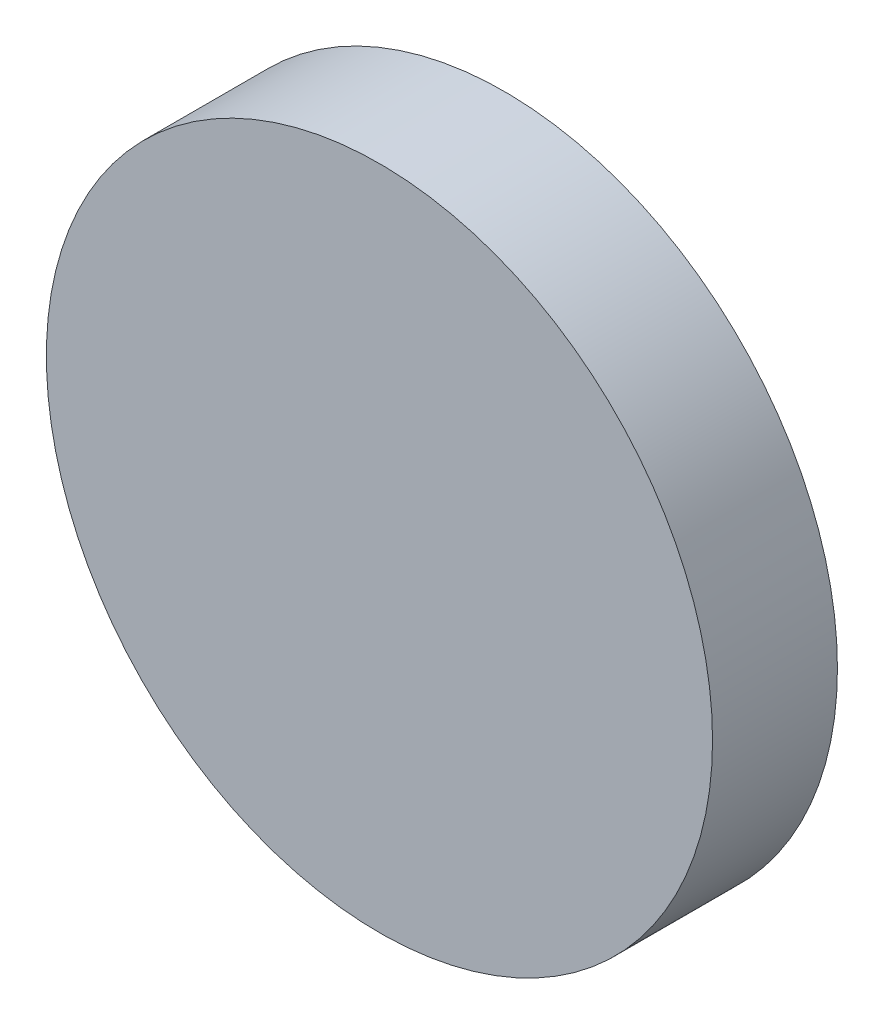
ISO-10303-21;
HEADER;
FILE_DESCRIPTION(('STEP AP214'),'2;1');
FILE_NAME('part.step','',(''),(''),'','','');
FILE_SCHEMA(('AUTOMOTIVE_DESIGN { 1 0 10303 214 1 1 1 1 }'));
ENDSEC;
DATA;
#1=APPLICATION_CONTEXT('core data for automotive mechanical design processes');
#2=APPLICATION_PROTOCOL_DEFINITION('international standard','automotive_design',2000,#1);
#3=PRODUCT_CONTEXT('',#1,'mechanical');
#4=PRODUCT('Part','Part','',(#3));
#5=PRODUCT_RELATED_PRODUCT_CATEGORY('part','',(#4));
#6=PRODUCT_DEFINITION_FORMATION('','',#4);
#7=PRODUCT_DEFINITION_CONTEXT('part definition',#1,'design');
#8=PRODUCT_DEFINITION('design','',#6,#7);
#9=PRODUCT_DEFINITION_SHAPE('','',#8);
#10=(LENGTH_UNIT() NAMED_UNIT(*) SI_UNIT(.MILLI.,.METRE.));
#11=(NAMED_UNIT(*) PLANE_ANGLE_UNIT() SI_UNIT($,.RADIAN.));
#12=(NAMED_UNIT(*) SI_UNIT($,.STERADIAN.) SOLID_ANGLE_UNIT());
#13=UNCERTAINTY_MEASURE_WITH_UNIT(LENGTH_MEASURE(1.E-05),#10,'distance_accuracy_value','');
#14=(GEOMETRIC_REPRESENTATION_CONTEXT(3) GLOBAL_UNCERTAINTY_ASSIGNED_CONTEXT((#13)) GLOBAL_UNIT_ASSIGNED_CONTEXT((#10,
#11,#12)) REPRESENTATION_CONTEXT('',''));
#15=CARTESIAN_POINT('',(0.,0.,0.));
#16=DIRECTION('',(0.,0.,1.));
#17=DIRECTION('',(1.,0.,0.));
#18=AXIS2_PLACEMENT_3D('',#15,#16,#17);
#19=CARTESIAN_POINT('',(1.38777878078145E-13,-8.88178419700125E-13,9.52499999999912));
#20=DIRECTION('',(0.,0.,-1.));
#21=DIRECTION('',(-1.,0.,0.));
#22=AXIS2_PLACEMENT_3D('',#19,#20,#21);
#23=CYLINDRICAL_SURFACE('',#22,25.4);
#24=CARTESIAN_POINT('',(1.38777878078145E-13,-8.88178419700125E-13,9.52499999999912));
#25=DIRECTION('',(0.,0.,1.));
#26=DIRECTION('',(1.,0.,0.));
#27=AXIS2_PLACEMENT_3D('',#24,#25,#26);
#28=CIRCLE('',#27,25.4);
#29=CARTESIAN_POINT('',(25.4000000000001,-8.86239692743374E-13,9.52499999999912));
#30=VERTEX_POINT('',#29);
#31=EDGE_CURVE('E10',#30,#30,#28,.T.);
#32=ORIENTED_EDGE('',*,*,#31,.F.);
#33=EDGE_LOOP('',(#32));
#34=FACE_BOUND('',#33,.T.);
#35=CARTESIAN_POINT('',(0.,0.,0.));
#36=DIRECTION('',(0.,0.,1.));
#37=DIRECTION('',(1.,0.,0.));
#38=AXIS2_PLACEMENT_3D('',#35,#36,#37);
#39=CIRCLE('',#38,25.4);
#40=CARTESIAN_POINT('',(25.4,0.,0.));
#41=VERTEX_POINT('',#40);
#42=EDGE_CURVE('E35',#41,#41,#39,.T.);
#43=ORIENTED_EDGE('',*,*,#42,.T.);
#44=EDGE_LOOP('',(#43));
#45=FACE_BOUND('',#44,.T.);
#46=ADVANCED_FACE('F32',(#34,#45),#23,.T.);
#47=CARTESIAN_POINT('',(1.38777878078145E-13,-8.88178419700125E-13,9.52499999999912));
#48=DIRECTION('',(0.,0.,1.));
#49=DIRECTION('',(1.,0.,0.));
#50=AXIS2_PLACEMENT_3D('',#47,#48,#49);
#51=PLANE('',#50);
#52=ORIENTED_EDGE('',*,*,#31,.T.);
#53=EDGE_LOOP('',(#52));
#54=FACE_BOUND('',#53,.T.);
#55=ADVANCED_FACE('F47',(#54),#51,.T.);
#56=CARTESIAN_POINT('',(0.,0.,0.));
#57=DIRECTION('',(0.,0.,1.));
#58=DIRECTION('',(1.,0.,0.));
#59=AXIS2_PLACEMENT_3D('',#56,#57,#58);
#60=PLANE('',#59);
#61=ORIENTED_EDGE('',*,*,#42,.F.);
#62=EDGE_LOOP('',(#61));
#63=FACE_BOUND('',#62,.T.);
#64=ADVANCED_FACE('F45',(#63),#60,.F.);
#65=CLOSED_SHELL('',(#46,#55,#64));
#66=MANIFOLD_SOLID_BREP('B2',#65);
#67=ADVANCED_BREP_SHAPE_REPRESENTATION('',(#18,#66),#14);
#68=SHAPE_DEFINITION_REPRESENTATION(#9,#67);
ENDSEC;
END-ISO-10303-21;
